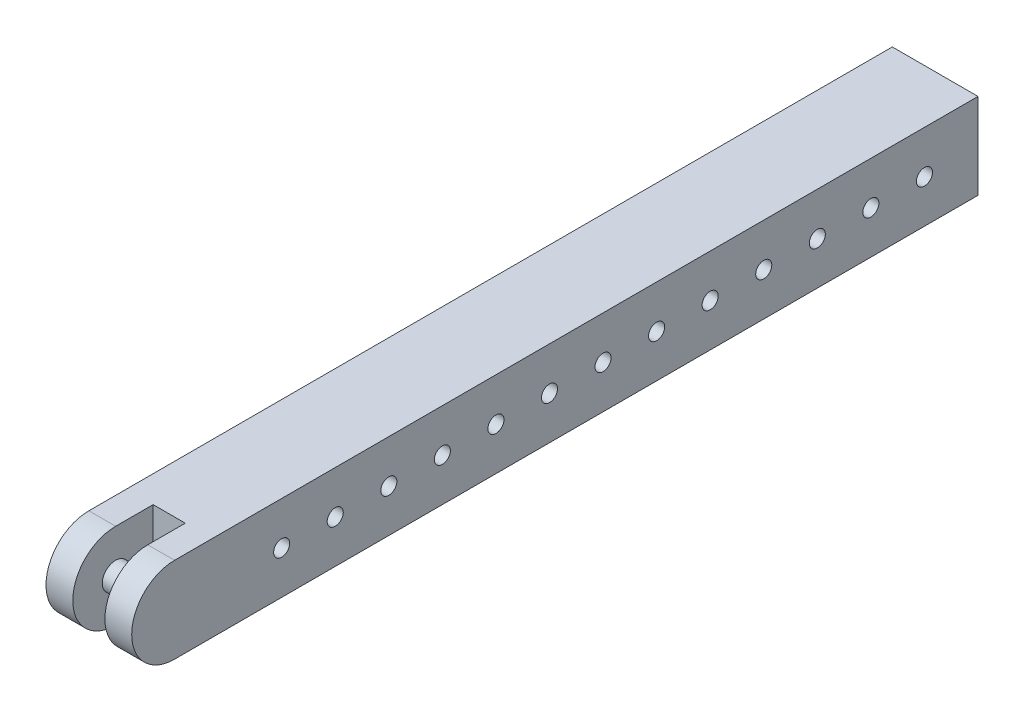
from build123d import *

# Parameters (mm, degrees)
ESQUISSE1_W             = 16
ESQUISSE1_H             = 16
BOSS_EXTRU_1_DEPTH      = 150
ESQUISSE2_R             = 8
BOSS_EXTRU_2_DEPTH      = 16
ESQUISSE3_W             = 6
ESQUISSE3_H             = 20.425883
ENL_V_MAT_EXTRU_1_DEPTH = 160.612029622
ESQUISSE4_R             = 2.5
BOSS_EXTRU_3_DEPTH      = 16
ESQUISSE5_R             = 1.5
ENL_V_MAT_EXTRU_2_DEPTH = 160.612029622


with BuildPart() as part:
    # Esquisse1 → Boss.-Extru.1 (new body)
    with BuildSketch(Plane.XY):
        with Locations((-8, 8)):
            Rectangle(ESQUISSE1_W, ESQUISSE1_H)
    extrude(amount=BOSS_EXTRU_1_DEPTH)

    # Esquisse2 → Boss.-Extru.2 (add)
    with BuildSketch(Plane(origin=(0, 0, 0), x_dir=(0, 0, -1), z_dir=(1, 0, 0))):
        with Locations((-150, 8)):
            Circle(ESQUISSE2_R)
    extrude(amount=-BOSS_EXTRU_2_DEPTH)

    # Esquisse3 → Enl_v. mat.-Extru.1 (cut, through all)
    with BuildSketch(Plane.XZ):
        with Locations((-8, 153.2129415)):
            Rectangle(ESQUISSE3_W, ESQUISSE3_H)
    extrude(amount=-ENL_V_MAT_EXTRU_1_DEPTH, mode=Mode.SUBTRACT)

    # Esquisse4 → Boss.-Extru.3 (add)
    with BuildSketch(Plane(origin=(0, 0, 0), x_dir=(0, 0, -1), z_dir=(1, 0, 0))):
        with Locations(Location((-150, 8, 0), (0, 0, 180))):
            Circle(ESQUISSE4_R)
    extrude(amount=-BOSS_EXTRU_3_DEPTH)

    # Esquisse5 → Enl_v. mat.-Extru.2 (cut, through all)
    with BuildSketch(Plane(origin=(0, 0, 0), x_dir=(0, 0, -1), z_dir=(1, 0, 0))):
        with Locations(Location((-130, 8, 0), (0, 0, 90))):
            Circle(ESQUISSE5_R)
        with Locations(Location((-120, 8, 0), (0, 0, 90))):
            Circle(ESQUISSE5_R)
        with Locations(Location((-110, 8, 0), (0, 0, 90))):
            Circle(ESQUISSE5_R)
        with Locations(Location((-100, 8, 0), (0, 0, 90))):
            Circle(ESQUISSE5_R)
        with Locations(Location((-90, 8, 0), (0, 0, 90))):
            Circle(ESQUISSE5_R)
        with Locations(Location((-80, 8, 0), (0, 0, 90))):
            Circle(ESQUISSE5_R)
        with Locations(Location((-70, 8, 0), (0, 0, 90))):
            Circle(ESQUISSE5_R)
        with Locations(Location((-60, 8, 0), (0, 0, 90))):
            Circle(ESQUISSE5_R)
        with Locations(Location((-50, 8, 0), (0, 0, 90))):
            Circle(ESQUISSE5_R)
        with Locations(Location((-40, 8, 0), (0, 0, 90))):
            Circle(ESQUISSE5_R)
        with Locations(Location((-30, 8, 0), (0, 0, 90))):
            Circle(ESQUISSE5_R)
        with Locations(Location((-20, 8, 0), (0, 0, 90))):
            Circle(ESQUISSE5_R)
        with Locations(Location((-10, 8, 0), (0, 0, 90))):
            Circle(ESQUISSE5_R)
    extrude(amount=-ENL_V_MAT_EXTRU_2_DEPTH, mode=Mode.SUBTRACT)


solid = part.part
